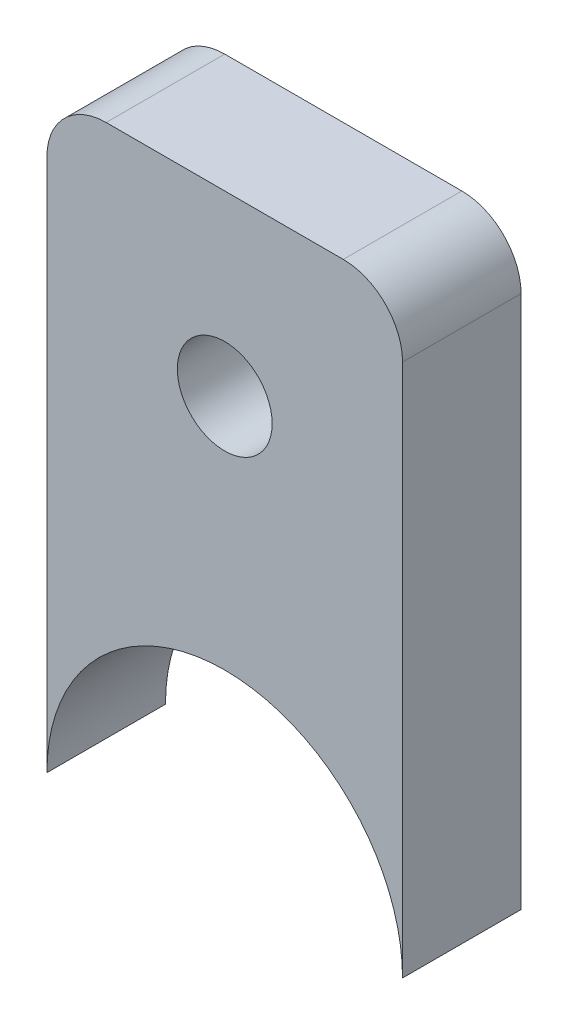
from build123d import *

# Parameters (mm, degrees)
EXTRUSION1_DEPTH        = 5
EXTRUSION1_DEPTH_BACK   = 5
CONG_1_R                = 5
ESQUISSE2_R             = 4
ENL_V_MAT_EXTRU_1_DEPTH = 10


with BuildPart() as part:
    # Esquisse1 → Extrusion1 (new, two sides: drawn at the far end of the back side and taken through both)
    with BuildSketch(Plane.XY.offset(-EXTRUSION1_DEPTH_BACK)):
        with BuildLine():
            Line((0, 0), (0, 50))
            Line((0, 50), (30, 50))
            Line((30, 50), (30, 0))
            ThreePointArc((30, 0), (15, 15), (0, 0))
        make_face()
    extrude(amount=EXTRUSION1_DEPTH + EXTRUSION1_DEPTH_BACK)

    # Cong_1
    cong_1_edges = [part.edges().sort_by_distance(p)[0] for p in [
        (0, 50, 0),
        (30, 50, 0),
    ]]
    fillet(cong_1_edges, radius=CONG_1_R)

    # Esquisse2 → Enl_v. mat.-Extru.1 (cut)
    with BuildSketch(Plane.XY.offset(5)):
        with Locations((15, 35)):
            Circle(ESQUISSE2_R)
    extrude(amount=-ENL_V_MAT_EXTRU_1_DEPTH, mode=Mode.SUBTRACT)


solid = part.part
